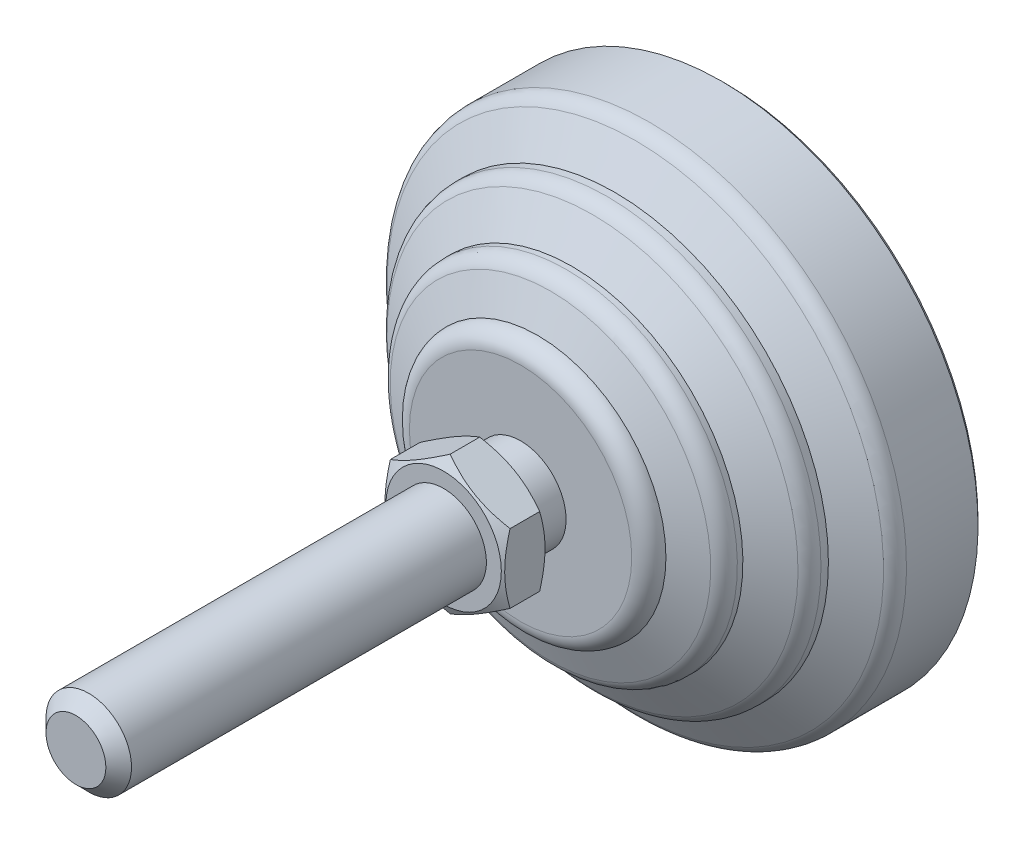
ISO-10303-21;
HEADER;
FILE_DESCRIPTION(('STEP AP214'),'2;1');
FILE_NAME('part.step','',(''),(''),'','','');
FILE_SCHEMA(('AUTOMOTIVE_DESIGN { 1 0 10303 214 1 1 1 1 }'));
ENDSEC;
DATA;
#1=APPLICATION_CONTEXT('core data for automotive mechanical design processes');
#2=APPLICATION_PROTOCOL_DEFINITION('international standard','automotive_design',2000,#1);
#3=PRODUCT_CONTEXT('',#1,'mechanical');
#4=PRODUCT('Part','Part','',(#3));
#5=PRODUCT_RELATED_PRODUCT_CATEGORY('part','',(#4));
#6=PRODUCT_DEFINITION_FORMATION('','',#4);
#7=PRODUCT_DEFINITION_CONTEXT('part definition',#1,'design');
#8=PRODUCT_DEFINITION('design','',#6,#7);
#9=PRODUCT_DEFINITION_SHAPE('','',#8);
#10=(LENGTH_UNIT() NAMED_UNIT(*) SI_UNIT(.MILLI.,.METRE.));
#11=(NAMED_UNIT(*) PLANE_ANGLE_UNIT() SI_UNIT($,.RADIAN.));
#12=(NAMED_UNIT(*) SI_UNIT($,.STERADIAN.) SOLID_ANGLE_UNIT());
#13=UNCERTAINTY_MEASURE_WITH_UNIT(LENGTH_MEASURE(1.E-05),#10,'distance_accuracy_value','');
#14=(GEOMETRIC_REPRESENTATION_CONTEXT(3) GLOBAL_UNCERTAINTY_ASSIGNED_CONTEXT((#13)) GLOBAL_UNIT_ASSIGNED_CONTEXT((#10,
#11,#12)) REPRESENTATION_CONTEXT('',''));
#15=CARTESIAN_POINT('',(0.,0.,0.));
#16=DIRECTION('',(0.,0.,1.));
#17=DIRECTION('',(1.,0.,0.));
#18=AXIS2_PLACEMENT_3D('',#15,#16,#17);
#19=CARTESIAN_POINT('',(-29.5,0.,0.));
#20=DIRECTION('',(0.,0.,1.));
#21=DIRECTION('',(0.,-1.,0.));
#22=AXIS2_PLACEMENT_3D('',#19,#20,#21);
#23=PLANE('',#22);
#24=CARTESIAN_POINT('',(0.,0.,0.));
#25=DIRECTION('',(0.,0.,-1.));
#26=DIRECTION('',(0.,1.,0.));
#27=AXIS2_PLACEMENT_3D('',#24,#25,#26);
#28=CIRCLE('',#27,29.5);
#29=CARTESIAN_POINT('',(0.,29.5,0.));
#30=VERTEX_POINT('',#29);
#31=EDGE_CURVE('E95',#30,#30,#28,.T.);
#32=ORIENTED_EDGE('',*,*,#31,.T.);
#33=EDGE_LOOP('',(#32));
#34=FACE_BOUND('',#33,.T.);
#35=ADVANCED_FACE('F14',(#34),#23,.F.);
#36=CARTESIAN_POINT('',(-5.32445501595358,0.,28.));
#37=DIRECTION('',(0.,0.,1.));
#38=DIRECTION('',(0.,-1.,0.));
#39=AXIS2_PLACEMENT_3D('',#36,#37,#38);
#40=PLANE('',#39);
#41=CARTESIAN_POINT('',(0.,0.,28.));
#42=DIRECTION('',(0.,0.,1.));
#43=DIRECTION('',(1.,0.,0.));
#44=AXIS2_PLACEMENT_3D('',#41,#42,#43);
#45=CIRCLE('',#44,6.75);
#46=CARTESIAN_POINT('',(6.75,0.,28.));
#47=VERTEX_POINT('',#46);
#48=EDGE_CURVE('E542',#47,#47,#45,.T.);
#49=ORIENTED_EDGE('',*,*,#48,.F.);
#50=EDGE_LOOP('',(#49));
#51=FACE_BOUND('',#50,.T.);
#52=CARTESIAN_POINT('',(0.,0.,28.));
#53=DIRECTION('',(0.,0.,-1.));
#54=DIRECTION('',(0.,1.,0.));
#55=AXIS2_PLACEMENT_3D('',#52,#53,#54);
#56=CIRCLE('',#55,5.32445501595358);
#57=CARTESIAN_POINT('',(0.,5.32445501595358,28.));
#58=VERTEX_POINT('',#57);
#59=EDGE_CURVE('E74',#58,#58,#56,.T.);
#60=ORIENTED_EDGE('',*,*,#59,.F.);
#61=EDGE_LOOP('',(#60));
#62=FACE_BOUND('',#61,.T.);
#63=ADVANCED_FACE('F271',(#51,#62),#40,.F.);
#64=CARTESIAN_POINT('',(0.,0.,0.));
#65=DIRECTION('',(0.,0.,-1.));
#66=DIRECTION('',(0.,1.,0.));
#67=AXIS2_PLACEMENT_3D('',#64,#65,#66);
#68=CYLINDRICAL_SURFACE('',#67,5.32445501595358);
#69=CARTESIAN_POINT('',(0.,0.,24.));
#70=DIRECTION('',(0.,0.,-1.));
#71=DIRECTION('',(0.,1.,0.));
#72=AXIS2_PLACEMENT_3D('',#69,#70,#71);
#73=CIRCLE('',#72,5.32445501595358);
#74=CARTESIAN_POINT('',(0.,5.32445501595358,24.));
#75=VERTEX_POINT('',#74);
#76=EDGE_CURVE('E131',#75,#75,#73,.T.);
#77=ORIENTED_EDGE('',*,*,#76,.F.);
#78=EDGE_LOOP('',(#77));
#79=FACE_BOUND('',#78,.T.);
#80=ORIENTED_EDGE('',*,*,#59,.T.);
#81=EDGE_LOOP('',(#80));
#82=FACE_BOUND('',#81,.T.);
#83=ADVANCED_FACE('F267',(#79,#82),#68,.T.);
#84=CARTESIAN_POINT('',(-13.,0.,24.));
#85=DIRECTION('',(0.,0.,-1.));
#86=DIRECTION('',(0.,1.,0.));
#87=AXIS2_PLACEMENT_3D('',#84,#85,#86);
#88=PLANE('',#87);
#89=CARTESIAN_POINT('',(0.,0.,24.));
#90=DIRECTION('',(0.,0.,-1.));
#91=DIRECTION('',(0.,1.,0.));
#92=AXIS2_PLACEMENT_3D('',#89,#90,#91);
#93=CIRCLE('',#92,13.);
#94=CARTESIAN_POINT('',(0.,13.,24.));
#95=VERTEX_POINT('',#94);
#96=EDGE_CURVE('E128',#95,#95,#93,.T.);
#97=ORIENTED_EDGE('',*,*,#96,.F.);
#98=EDGE_LOOP('',(#97));
#99=FACE_BOUND('',#98,.T.);
#100=ORIENTED_EDGE('',*,*,#76,.T.);
#101=EDGE_LOOP('',(#100));
#102=FACE_BOUND('',#101,.T.);
#103=ADVANCED_FACE('F263',(#99,#102),#88,.F.);
#104=CARTESIAN_POINT('',(0.,0.,22.));
#105=DIRECTION('',(0.,0.,-1.));
#106=DIRECTION('',(0.,1.,0.));
#107=AXIS2_PLACEMENT_3D('',#104,#105,#106);
#108=TOROIDAL_SURFACE('',#107,13.,2.);
#109=CARTESIAN_POINT('',(0.,0.,22.));
#110=DIRECTION('',(0.,0.,-1.));
#111=DIRECTION('',(0.,1.,0.));
#112=AXIS2_PLACEMENT_3D('',#109,#110,#111);
#113=CIRCLE('',#112,15.);
#114=CARTESIAN_POINT('',(0.,15.,22.));
#115=VERTEX_POINT('',#114);
#116=EDGE_CURVE('E125',#115,#115,#113,.T.);
#117=ORIENTED_EDGE('',*,*,#116,.F.);
#118=EDGE_LOOP('',(#117));
#119=FACE_BOUND('',#118,.T.);
#120=ORIENTED_EDGE('',*,*,#96,.T.);
#121=EDGE_LOOP('',(#120));
#122=FACE_BOUND('',#121,.T.);
#123=ADVANCED_FACE('F259',(#119,#122),#108,.T.);
#124=CARTESIAN_POINT('',(0.,0.,22.));
#125=DIRECTION('',(0.,0.,-1.));
#126=DIRECTION('',(0.,1.,0.));
#127=AXIS2_PLACEMENT_3D('',#124,#125,#126);
#128=CONICAL_SURFACE('',#127,15.,1.19028994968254);
#129=CARTESIAN_POINT('',(0.,0.,20.5028874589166));
#130=DIRECTION('',(0.,0.,-1.));
#131=DIRECTION('',(0.,1.,0.));
#132=AXIS2_PLACEMENT_3D('',#129,#130,#131);
#133=CIRCLE('',#132,18.7427813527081);
#134=CARTESIAN_POINT('',(0.,18.7427813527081,20.5028874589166));
#135=VERTEX_POINT('',#134);
#136=EDGE_CURVE('E122',#135,#135,#133,.T.);
#137=ORIENTED_EDGE('',*,*,#136,.F.);
#138=EDGE_LOOP('',(#137));
#139=FACE_BOUND('',#138,.T.);
#140=ORIENTED_EDGE('',*,*,#116,.T.);
#141=EDGE_LOOP('',(#140));
#142=FACE_BOUND('',#141,.T.);
#143=ADVANCED_FACE('F255',(#139,#142),#128,.T.);
#144=CARTESIAN_POINT('',(0.,0.,18.6459340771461));
#145=DIRECTION('',(0.,0.,-1.));
#146=DIRECTION('',(0.,1.,0.));
#147=AXIS2_PLACEMENT_3D('',#144,#145,#146);
#148=TOROIDAL_SURFACE('',#147,18.,2.00000000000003);
#149=CARTESIAN_POINT('',(0.,0.,18.645934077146));
#150=DIRECTION('',(0.,0.,-1.));
#151=DIRECTION('',(0.,1.,0.));
#152=AXIS2_PLACEMENT_3D('',#149,#150,#151);
#153=CIRCLE('',#152,20.);
#154=CARTESIAN_POINT('',(0.,20.,18.645934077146));
#155=VERTEX_POINT('',#154);
#156=EDGE_CURVE('E119',#155,#155,#153,.T.);
#157=ORIENTED_EDGE('',*,*,#156,.F.);
#158=EDGE_LOOP('',(#157));
#159=FACE_BOUND('',#158,.T.);
#160=ORIENTED_EDGE('',*,*,#136,.T.);
#161=EDGE_LOOP('',(#160));
#162=FACE_BOUND('',#161,.T.);
#163=ADVANCED_FACE('F251',(#159,#162),#148,.T.);
#164=CARTESIAN_POINT('',(0.,0.,0.));
#165=DIRECTION('',(0.,0.,-1.));
#166=DIRECTION('',(0.,1.,0.));
#167=AXIS2_PLACEMENT_3D('',#164,#165,#166);
#168=CYLINDRICAL_SURFACE('',#167,20.);
#169=CARTESIAN_POINT('',(0.,0.,18.));
#170=DIRECTION('',(0.,0.,-1.));
#171=DIRECTION('',(0.,1.,0.));
#172=AXIS2_PLACEMENT_3D('',#169,#170,#171);
#173=CIRCLE('',#172,20.);
#174=CARTESIAN_POINT('',(0.,20.,18.));
#175=VERTEX_POINT('',#174);
#176=EDGE_CURVE('E116',#175,#175,#173,.T.);
#177=ORIENTED_EDGE('',*,*,#176,.F.);
#178=EDGE_LOOP('',(#177));
#179=FACE_BOUND('',#178,.T.);
#180=ORIENTED_EDGE('',*,*,#156,.T.);
#181=EDGE_LOOP('',(#180));
#182=FACE_BOUND('',#181,.T.);
#183=ADVANCED_FACE('F247',(#179,#182),#168,.T.);
#184=CARTESIAN_POINT('',(0.,0.,18.));
#185=DIRECTION('',(0.,0.,-1.));
#186=DIRECTION('',(0.,1.,0.));
#187=AXIS2_PLACEMENT_3D('',#184,#185,#186);
#188=CONICAL_SURFACE('',#187,20.,1.03037682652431);
#189=CARTESIAN_POINT('',(0.,0.,15.5826050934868));
#190=DIRECTION('',(0.,0.,-1.));
#191=DIRECTION('',(0.,1.,0.));
#192=AXIS2_PLACEMENT_3D('',#189,#190,#191);
#193=CIRCLE('',#192,24.0289915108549);
#194=CARTESIAN_POINT('',(0.,24.0289915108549,15.5826050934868));
#195=VERTEX_POINT('',#194);
#196=EDGE_CURVE('E113',#195,#195,#193,.T.);
#197=ORIENTED_EDGE('',*,*,#196,.F.);
#198=EDGE_LOOP('',(#197));
#199=FACE_BOUND('',#198,.T.);
#200=ORIENTED_EDGE('',*,*,#176,.T.);
#201=EDGE_LOOP('',(#200));
#202=FACE_BOUND('',#201,.T.);
#203=ADVANCED_FACE('F243',(#199,#202),#188,.T.);
#204=CARTESIAN_POINT('',(0.,0.,13.8676192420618));
#205=DIRECTION('',(0.,0.,-1.));
#206=DIRECTION('',(0.,1.,0.));
#207=AXIS2_PLACEMENT_3D('',#204,#205,#206);
#208=TOROIDAL_SURFACE('',#207,23.,2.00000000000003);
#209=CARTESIAN_POINT('',(0.,0.,13.8676192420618));
#210=DIRECTION('',(0.,0.,-1.));
#211=DIRECTION('',(0.,1.,0.));
#212=AXIS2_PLACEMENT_3D('',#209,#210,#211);
#213=CIRCLE('',#212,25.);
#214=CARTESIAN_POINT('',(0.,25.,13.8676192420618));
#215=VERTEX_POINT('',#214);
#216=EDGE_CURVE('E110',#215,#215,#213,.T.);
#217=ORIENTED_EDGE('',*,*,#216,.F.);
#218=EDGE_LOOP('',(#217));
#219=FACE_BOUND('',#218,.T.);
#220=ORIENTED_EDGE('',*,*,#196,.T.);
#221=EDGE_LOOP('',(#220));
#222=FACE_BOUND('',#221,.T.);
#223=ADVANCED_FACE('F239',(#219,#222),#208,.T.);
#224=CARTESIAN_POINT('',(0.,0.,0.));
#225=DIRECTION('',(0.,0.,-1.));
#226=DIRECTION('',(0.,1.,0.));
#227=AXIS2_PLACEMENT_3D('',#224,#225,#226);
#228=CYLINDRICAL_SURFACE('',#227,25.);
#229=CARTESIAN_POINT('',(0.,0.,13.));
#230=DIRECTION('',(0.,0.,-1.));
#231=DIRECTION('',(0.,1.,0.));
#232=AXIS2_PLACEMENT_3D('',#229,#230,#231);
#233=CIRCLE('',#232,25.);
#234=CARTESIAN_POINT('',(0.,25.,13.));
#235=VERTEX_POINT('',#234);
#236=EDGE_CURVE('E107',#235,#235,#233,.T.);
#237=ORIENTED_EDGE('',*,*,#236,.F.);
#238=EDGE_LOOP('',(#237));
#239=FACE_BOUND('',#238,.T.);
#240=ORIENTED_EDGE('',*,*,#216,.T.);
#241=EDGE_LOOP('',(#240));
#242=FACE_BOUND('',#241,.T.);
#243=ADVANCED_FACE('F235',(#239,#242),#228,.T.);
#244=CARTESIAN_POINT('',(0.,0.,13.));
#245=DIRECTION('',(0.,0.,-1.));
#246=DIRECTION('',(0.,1.,0.));
#247=AXIS2_PLACEMENT_3D('',#244,#245,#246);
#248=CONICAL_SURFACE('',#247,25.,1.03037682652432);
#249=CARTESIAN_POINT('',(0.,0.,10.5826050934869));
#250=DIRECTION('',(0.,0.,-1.));
#251=DIRECTION('',(0.,1.,0.));
#252=AXIS2_PLACEMENT_3D('',#249,#250,#251);
#253=CIRCLE('',#252,29.028991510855);
#254=CARTESIAN_POINT('',(0.,29.028991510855,10.5826050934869));
#255=VERTEX_POINT('',#254);
#256=EDGE_CURVE('E104',#255,#255,#253,.T.);
#257=ORIENTED_EDGE('',*,*,#256,.F.);
#258=EDGE_LOOP('',(#257));
#259=FACE_BOUND('',#258,.T.);
#260=ORIENTED_EDGE('',*,*,#236,.T.);
#261=EDGE_LOOP('',(#260));
#262=FACE_BOUND('',#261,.T.);
#263=ADVANCED_FACE('F231',(#259,#262),#248,.T.);
#264=CARTESIAN_POINT('',(0.,0.,8.86761924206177));
#265=DIRECTION('',(0.,0.,-1.));
#266=DIRECTION('',(0.,1.,0.));
#267=AXIS2_PLACEMENT_3D('',#264,#265,#266);
#268=TOROIDAL_SURFACE('',#267,28.,2.00000000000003);
#269=CARTESIAN_POINT('',(0.,0.,8.86761924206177));
#270=DIRECTION('',(0.,0.,-1.));
#271=DIRECTION('',(0.,1.,0.));
#272=AXIS2_PLACEMENT_3D('',#269,#270,#271);
#273=CIRCLE('',#272,30.);
#274=CARTESIAN_POINT('',(0.,30.,8.86761924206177));
#275=VERTEX_POINT('',#274);
#276=EDGE_CURVE('E101',#275,#275,#273,.T.);
#277=ORIENTED_EDGE('',*,*,#276,.F.);
#278=EDGE_LOOP('',(#277));
#279=FACE_BOUND('',#278,.T.);
#280=ORIENTED_EDGE('',*,*,#256,.T.);
#281=EDGE_LOOP('',(#280));
#282=FACE_BOUND('',#281,.T.);
#283=ADVANCED_FACE('F227',(#279,#282),#268,.T.);
#284=CARTESIAN_POINT('',(0.,0.,0.));
#285=DIRECTION('',(0.,0.,-1.));
#286=DIRECTION('',(0.,1.,0.));
#287=AXIS2_PLACEMENT_3D('',#284,#285,#286);
#288=CYLINDRICAL_SURFACE('',#287,30.);
#289=CARTESIAN_POINT('',(0.,0.,0.499999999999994));
#290=DIRECTION('',(0.,0.,-1.));
#291=DIRECTION('',(0.,1.,0.));
#292=AXIS2_PLACEMENT_3D('',#289,#290,#291);
#293=CIRCLE('',#292,30.);
#294=CARTESIAN_POINT('',(0.,30.,0.499999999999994));
#295=VERTEX_POINT('',#294);
#296=EDGE_CURVE('E98',#295,#295,#293,.T.);
#297=ORIENTED_EDGE('',*,*,#296,.F.);
#298=EDGE_LOOP('',(#297));
#299=FACE_BOUND('',#298,.T.);
#300=ORIENTED_EDGE('',*,*,#276,.T.);
#301=EDGE_LOOP('',(#300));
#302=FACE_BOUND('',#301,.T.);
#303=ADVANCED_FACE('F223',(#299,#302),#288,.T.);
#304=CARTESIAN_POINT('',(0.,0.,0.499999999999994));
#305=DIRECTION('',(0.,0.,1.));
#306=DIRECTION('',(0.,-1.,0.));
#307=AXIS2_PLACEMENT_3D('',#304,#305,#306);
#308=CONICAL_SURFACE('',#307,30.,0.785398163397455);
#309=ORIENTED_EDGE('',*,*,#31,.F.);
#310=EDGE_LOOP('',(#309));
#311=FACE_BOUND('',#310,.T.);
#312=ORIENTED_EDGE('',*,*,#296,.T.);
#313=EDGE_LOOP('',(#312));
#314=FACE_BOUND('',#313,.T.);
#315=ADVANCED_FACE('F150',(#311,#314),#308,.T.);
#316=CARTESIAN_POINT('',(0.,0.,28.));
#317=DIRECTION('',(0.,0.,1.));
#318=DIRECTION('',(1.,0.,0.));
#319=AXIS2_PLACEMENT_3D('',#316,#317,#318);
#320=CONICAL_SURFACE('',#319,6.75,1.0471975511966);
#321=CARTESIAN_POINT('',(0.000200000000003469,-8.0830192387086,28.7696190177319));
#322=CARTESIAN_POINT('',(-0.153667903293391,-7.99418356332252,28.7183374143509));
#323=CARTESIAN_POINT('',(-0.30810950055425,-7.90501666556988,28.669383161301));
#324=CARTESIAN_POINT('',(-0.618246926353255,-7.72595873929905,28.5767703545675));
#325=CARTESIAN_POINT('',(-0.773943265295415,-7.63606741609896,28.5331140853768));
#326=CARTESIAN_POINT('',(-1.24352516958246,-7.36495417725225,28.4109491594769));
#327=CARTESIAN_POINT('',(-1.5592643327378,-7.18266208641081,28.3414631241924));
#328=CARTESIAN_POINT('',(-2.03176224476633,-6.90986528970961,28.2599825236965));
#329=CARTESIAN_POINT('',(-2.18710922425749,-6.82017566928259,28.2367710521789));
#330=CARTESIAN_POINT('',(-2.49850511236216,-6.64039116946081,28.1978487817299));
#331=CARTESIAN_POINT('',(-2.65455395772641,-6.55029632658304,28.1821373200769));
#332=CARTESIAN_POINT('',(-2.96692267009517,-6.36995016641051,28.1586154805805));
#333=CARTESIAN_POINT('',(-3.12324202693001,-6.27969914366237,28.1507961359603));
#334=CARTESIAN_POINT('',(-3.43601650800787,-6.09911871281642,28.1432178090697));
#335=CARTESIAN_POINT('',(-3.59247162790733,-6.00878930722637,28.1434585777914));
#336=CARTESIAN_POINT('',(-4.02110687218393,-5.76131663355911,28.155197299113));
#337=CARTESIAN_POINT('',(-4.2931466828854,-5.60425437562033,28.1749033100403));
#338=CARTESIAN_POINT('',(-4.83541944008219,-5.29117305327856,28.2373910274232));
#339=CARTESIAN_POINT('',(-5.10565047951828,-5.13515508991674,28.2801940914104));
#340=CARTESIAN_POINT('',(-5.64901454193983,-4.82144370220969,28.3871892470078));
#341=CARTESIAN_POINT('',(-5.92207900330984,-4.6637898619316,28.4518346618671));
#342=CARTESIAN_POINT('',(-6.46413578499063,-4.35083323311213,28.5985536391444));
#343=CARTESIAN_POINT('',(-6.73313504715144,-4.19552643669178,28.680592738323));
#344=CARTESIAN_POINT('',(-7.0002,-4.04133641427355,28.7696190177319));
#345=B_SPLINE_CURVE_WITH_KNOTS('',3,(#321,#322,#323,#324,#325,#326,#327,#328,#329,#330,#331,
#332,#333,#334,#335,#336,#337,#338,#339,#340,#341,#342,#343,#344),.UNSPECIFIED.,.F.,.F.,(4,2,2,
2,2,2,2,2,2,2,2,4),(0.,0.554727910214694,1.10969417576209,2.2219327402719,2.76443041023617,
3.30688013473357,3.8487128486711,4.39052882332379,5.33376515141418,6.27787517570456,
7.24292418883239,8.20607866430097),.UNSPECIFIED.);
#346=CARTESIAN_POINT('',(0.,-8.08290376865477,28.7695523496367));
#347=VERTEX_POINT('',#346);
#348=CARTESIAN_POINT('',(-7.,-4.04145188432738,28.7695523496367));
#349=VERTEX_POINT('',#348);
#350=EDGE_CURVE('E69',#347,#349,#345,.T.);
#351=ORIENTED_EDGE('',*,*,#350,.T.);
#352=CARTESIAN_POINT('',(-7.,-10.844546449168,31.5550484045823));
#353=CARTESIAN_POINT('',(-7.,-10.5389041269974,31.4068299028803));
#354=CARTESIAN_POINT('',(-7.,-10.2325589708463,31.2600358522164));
#355=CARTESIAN_POINT('',(-7.,-9.61808916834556,30.9700980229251));
#356=CARTESIAN_POINT('',(-7.,-9.30996424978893,30.8269548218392));
#357=CARTESIAN_POINT('',(-7.,-8.68996814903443,30.5443975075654));
#358=CARTESIAN_POINT('',(-7.,-8.37808569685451,30.4050080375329));
#359=CARTESIAN_POINT('',(-7.,-7.75183627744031,30.1319484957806));
#360=CARTESIAN_POINT('',(-7.,-7.43746942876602,29.9982781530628));
#361=CARTESIAN_POINT('',(-7.,-6.79564890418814,29.7340076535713));
#362=CARTESIAN_POINT('',(-7.,-6.46809807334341,29.6036421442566));
#363=CARTESIAN_POINT('',(-7.,-5.80916092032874,29.3528049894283));
#364=CARTESIAN_POINT('',(-7.,-5.47777417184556,29.232334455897));
#365=CARTESIAN_POINT('',(-7.,-4.81125785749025,29.0044584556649));
#366=CARTESIAN_POINT('',(-7.,-4.47613746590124,28.8970264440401));
#367=CARTESIAN_POINT('',(-7.,-3.80110167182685,28.6986808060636));
#368=CARTESIAN_POINT('',(-7.,-3.46118781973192,28.6077619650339));
#369=CARTESIAN_POINT('',(-7.,-2.77819933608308,28.4473021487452));
#370=CARTESIAN_POINT('',(-7.,-2.43515258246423,28.3776457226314));
#371=CARTESIAN_POINT('',(-7.,-1.91746759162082,28.2921293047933));
#372=CARTESIAN_POINT('',(-7.,-1.74437399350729,28.2667840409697));
#373=CARTESIAN_POINT('',(-7.,-1.39733027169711,28.222913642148));
#374=CARTESIAN_POINT('',(-7.,-1.22338023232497,28.2043878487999));
#375=CARTESIAN_POINT('',(-7.,-0.877124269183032,28.1747572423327));
#376=CARTESIAN_POINT('',(-7.,-0.704826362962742,28.1635591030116));
#377=CARTESIAN_POINT('',(-7.,-0.359911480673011,28.1484581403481));
#378=CARTESIAN_POINT('',(-7.,-0.187294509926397,28.144555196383));
#379=CARTESIAN_POINT('',(-7.,0.157950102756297,28.1441376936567));
#380=CARTESIAN_POINT('',(-7.,0.330577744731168,28.1476231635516));
#381=CARTESIAN_POINT('',(-7.,0.675533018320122,28.1618975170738));
#382=CARTESIAN_POINT('',(-7.,0.847860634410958,28.1726867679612));
#383=CARTESIAN_POINT('',(-7.,1.26235657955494,28.2071940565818));
#384=CARTESIAN_POINT('',(-7.,1.50424091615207,28.2343963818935));
#385=CARTESIAN_POINT('',(-7.,1.98619555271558,28.3017040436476));
#386=CARTESIAN_POINT('',(-7.,2.22626560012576,28.3418111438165));
#387=CARTESIAN_POINT('',(-7.,2.94349027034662,28.4793613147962));
#388=CARTESIAN_POINT('',(-7.,3.4173882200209,28.5940077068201));
#389=CARTESIAN_POINT('',(-7.,4.12597985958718,28.7925823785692));
#390=CARTESIAN_POINT('',(-7.,4.36435477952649,28.8641280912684));
#391=CARTESIAN_POINT('',(-7.,4.83878893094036,29.0145927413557));
#392=CARTESIAN_POINT('',(-7.,5.07484814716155,29.093511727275));
#393=CARTESIAN_POINT('',(-7.,5.54472628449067,29.2574614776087));
#394=CARTESIAN_POINT('',(-7.,5.77854592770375,29.342490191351));
#395=CARTESIAN_POINT('',(-7.,6.24425179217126,29.5176647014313));
#396=CARTESIAN_POINT('',(-7.,6.47613803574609,29.6078104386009));
#397=CARTESIAN_POINT('',(-7.,7.02208902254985,29.8258788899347));
#398=CARTESIAN_POINT('',(-7.,7.33542067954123,29.9556335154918));
#399=CARTESIAN_POINT('',(-7.,7.95943200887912,30.2213883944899));
#400=CARTESIAN_POINT('',(-7.,8.27011152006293,30.3573890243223));
#401=CARTESIAN_POINT('',(-7.,8.88930487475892,30.6343847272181));
#402=CARTESIAN_POINT('',(-7.,9.19781827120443,30.7753807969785));
#403=CARTESIAN_POINT('',(-7.,9.81299002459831,31.0613703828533));
#404=CARTESIAN_POINT('',(-7.,10.1196483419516,31.2063639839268));
#405=CARTESIAN_POINT('',(-7.,10.7317317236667,31.4997527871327));
#406=CARTESIAN_POINT('',(-7.,11.0371551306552,31.6481514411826));
#407=CARTESIAN_POINT('',(-7.,11.6466883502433,31.947624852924));
#408=CARTESIAN_POINT('',(-7.,11.9507981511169,32.0986996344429));
#409=CARTESIAN_POINT('',(-7.,12.861390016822,32.5551879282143));
#410=CARTESIAN_POINT('',(-7.,13.4662159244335,32.8639047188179));
#411=CARTESIAN_POINT('',(-7.,14.6222304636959,33.4614715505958));
#412=CARTESIAN_POINT('',(-7.,15.1736767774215,33.7498253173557));
#413=CARTESIAN_POINT('',(-7.,16.2745203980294,34.3304616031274));
#414=CARTESIAN_POINT('',(-7.,16.823917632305,34.6227442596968));
#415=CARTESIAN_POINT('',(-7.,17.9197531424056,35.2095745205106));
#416=CARTESIAN_POINT('',(-7.,18.4661953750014,35.5041147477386));
#417=CARTESIAN_POINT('',(-7.,19.5577691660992,36.0955438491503));
#418=CARTESIAN_POINT('',(-7.,20.1029007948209,36.3924325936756));
#419=CARTESIAN_POINT('',(-7.,20.647549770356,36.690198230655));
#420=B_SPLINE_CURVE_WITH_KNOTS('',3,(#352,#353,#354,#355,#356,#357,#358,#359,#360,#361,#362,
#363,#364,#365,#366,#367,#368,#369,#370,#371,#372,#373,#374,#375,#376,#377,#378,#379,#380,#381,
#382,#383,#384,#385,#386,#387,#388,#389,#390,#391,#392,#393,#394,#395,#396,#397,#398,#399,#400,
#401,#402,#403,#404,#405,#406,#407,#408,#409,#410,#411,#412,#413,#414,#415,#416,#417,#418,#419),
.UNSPECIFIED.,.F.,.F.,(4,2,2,2,2,2,2,2,2,2,2,2,2,2,2,2,2,2,2,2,2,2,2,2,2,2,2,2,2,2,2,2,2,4),(0.,
1.01906773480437,2.03829569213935,3.06309152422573,4.0878387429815,5.14533581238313,
6.20295155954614,7.25837665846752,8.31346788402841,9.36272385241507,9.88742869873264,
10.4120828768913,10.9299177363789,11.4477440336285,11.9655723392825,12.4834266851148,
13.2132414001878,13.9431559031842,15.4037984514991,16.1503776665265,16.8969617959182,
17.643296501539,18.3896225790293,19.406938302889,20.4243154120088,21.4418966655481,
22.4594995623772,23.478184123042,24.4968777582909,26.5339939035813,28.4008375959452,
30.2677468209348,32.1300450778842,33.9922412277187),.UNSPECIFIED.);
#421=CARTESIAN_POINT('',(-7.,4.04145188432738,28.7695523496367));
#422=VERTEX_POINT('',#421);
#423=EDGE_CURVE('E80',#349,#422,#420,.T.);
#424=ORIENTED_EDGE('',*,*,#423,.T.);
#425=CARTESIAN_POINT('',(-7.0002,4.04133641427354,28.7696190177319));
#426=CARTESIAN_POINT('',(-6.84633209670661,4.13017208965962,28.7183374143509));
#427=CARTESIAN_POINT('',(-6.69189049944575,4.21933898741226,28.669383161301));
#428=CARTESIAN_POINT('',(-6.38175307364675,4.39839691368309,28.5767703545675));
#429=CARTESIAN_POINT('',(-6.22605673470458,4.48828823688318,28.5331140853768));
#430=CARTESIAN_POINT('',(-5.75647483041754,4.75940147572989,28.4109491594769));
#431=CARTESIAN_POINT('',(-5.4407356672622,4.94169356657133,28.3414631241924));
#432=CARTESIAN_POINT('',(-4.96823775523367,5.21449036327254,28.2599825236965));
#433=CARTESIAN_POINT('',(-4.81289077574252,5.30417998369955,28.2367710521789));
#434=CARTESIAN_POINT('',(-4.50149488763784,5.48396448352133,28.1978487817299));
#435=CARTESIAN_POINT('',(-4.34544604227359,5.57405932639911,28.1821373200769));
#436=CARTESIAN_POINT('',(-4.03307732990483,5.75440548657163,28.1586154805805));
#437=CARTESIAN_POINT('',(-3.87675797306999,5.84465650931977,28.1507961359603));
#438=CARTESIAN_POINT('',(-3.56398349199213,6.02523694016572,28.1432178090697));
#439=CARTESIAN_POINT('',(-3.40752837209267,6.11556634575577,28.1434585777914));
#440=CARTESIAN_POINT('',(-2.97889312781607,6.36303901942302,28.155197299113));
#441=CARTESIAN_POINT('',(-2.7068533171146,6.52010127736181,28.1749033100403));
#442=CARTESIAN_POINT('',(-2.16458055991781,6.83318259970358,28.2373910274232));
#443=CARTESIAN_POINT('',(-1.89434952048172,6.9892005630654,28.2801940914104));
#444=CARTESIAN_POINT('',(-1.35098545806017,7.30291195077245,28.3871892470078));
#445=CARTESIAN_POINT('',(-1.07792099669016,7.46056579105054,28.4518346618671));
#446=CARTESIAN_POINT('',(-0.535864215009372,7.77352241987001,28.5985536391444));
#447=CARTESIAN_POINT('',(-0.266864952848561,7.92882921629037,28.680592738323));
#448=CARTESIAN_POINT('',(0.000199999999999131,8.0830192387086,28.7696190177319));
#449=B_SPLINE_CURVE_WITH_KNOTS('',3,(#425,#426,#427,#428,#429,#430,#431,#432,#433,#434,#435,
#436,#437,#438,#439,#440,#441,#442,#443,#444,#445,#446,#447,#448),.UNSPECIFIED.,.F.,.F.,(4,2,2,
2,2,2,2,2,2,2,2,4),(0.,0.554727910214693,1.10969417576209,2.2219327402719,2.76443041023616,
3.30688013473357,3.84871284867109,4.39052882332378,5.33376515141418,6.27787517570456,
7.2429241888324,8.20607866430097),.UNSPECIFIED.);
#450=CARTESIAN_POINT('',(0.,8.08290376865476,28.7695523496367));
#451=VERTEX_POINT('',#450);
#452=EDGE_CURVE('E175',#422,#451,#449,.T.);
#453=ORIENTED_EDGE('',*,*,#452,.T.);
#454=CARTESIAN_POINT('',(-0.000200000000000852,8.0830192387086,28.7696190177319));
#455=CARTESIAN_POINT('',(0.15366790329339,7.99418356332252,28.7183374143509));
#456=CARTESIAN_POINT('',(0.308109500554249,7.90501666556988,28.669383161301));
#457=CARTESIAN_POINT('',(0.618246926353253,7.72595873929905,28.5767703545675));
#458=CARTESIAN_POINT('',(0.773943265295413,7.63606741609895,28.5331140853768));
#459=CARTESIAN_POINT('',(1.24352516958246,7.36495417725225,28.4109491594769));
#460=CARTESIAN_POINT('',(1.5592643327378,7.18266208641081,28.3414631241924));
#461=CARTESIAN_POINT('',(2.03176224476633,6.9098652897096,28.2599825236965));
#462=CARTESIAN_POINT('',(2.18710922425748,6.82017566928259,28.2367710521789));
#463=CARTESIAN_POINT('',(2.49850511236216,6.64039116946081,28.1978487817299));
#464=CARTESIAN_POINT('',(2.65455395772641,6.55029632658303,28.1821373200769));
#465=CARTESIAN_POINT('',(2.96692267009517,6.36995016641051,28.1586154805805));
#466=CARTESIAN_POINT('',(3.12324202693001,6.27969914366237,28.1507961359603));
#467=CARTESIAN_POINT('',(3.43601650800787,6.09911871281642,28.1432178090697));
#468=CARTESIAN_POINT('',(3.59247162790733,6.00878930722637,28.1434585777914));
#469=CARTESIAN_POINT('',(4.02110687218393,5.76131663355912,28.155197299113));
#470=CARTESIAN_POINT('',(4.2931466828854,5.60425437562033,28.1749033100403));
#471=CARTESIAN_POINT('',(4.83541944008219,5.29117305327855,28.2373910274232));
#472=CARTESIAN_POINT('',(5.10565047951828,5.13515508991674,28.2801940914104));
#473=CARTESIAN_POINT('',(5.64901454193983,4.82144370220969,28.3871892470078));
#474=CARTESIAN_POINT('',(5.92207900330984,4.66378986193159,28.4518346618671));
#475=CARTESIAN_POINT('',(6.46413578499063,4.35083323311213,28.5985536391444));
#476=CARTESIAN_POINT('',(6.73313504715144,4.19552643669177,28.680592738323));
#477=CARTESIAN_POINT('',(7.0002,4.04133641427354,28.7696190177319));
#478=B_SPLINE_CURVE_WITH_KNOTS('',3,(#454,#455,#456,#457,#458,#459,#460,#461,#462,#463,#464,
#465,#466,#467,#468,#469,#470,#471,#472,#473,#474,#475,#476,#477),.UNSPECIFIED.,.F.,.F.,(4,2,2,
2,2,2,2,2,2,2,2,4),(0.,0.554727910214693,1.10969417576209,2.2219327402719,2.76443041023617,
3.30688013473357,3.8487128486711,4.39052882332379,5.33376515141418,6.27787517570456,
7.2429241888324,8.20607866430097),.UNSPECIFIED.);
#479=CARTESIAN_POINT('',(7.,4.04145188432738,28.7695523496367));
#480=VERTEX_POINT('',#479);
#481=EDGE_CURVE('E168',#451,#480,#478,.T.);
#482=ORIENTED_EDGE('',*,*,#481,.T.);
#483=CARTESIAN_POINT('',(7.,-10.8445464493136,31.5550484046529));
#484=CARTESIAN_POINT('',(7.,-10.5389041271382,31.406829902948));
#485=CARTESIAN_POINT('',(7.,-10.2325589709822,31.2600358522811));
#486=CARTESIAN_POINT('',(7.,-9.61808916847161,30.970098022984));
#487=CARTESIAN_POINT('',(7.,-9.30996424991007,30.8269548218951));
#488=CARTESIAN_POINT('',(7.,-8.68996814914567,30.5443975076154));
#489=CARTESIAN_POINT('',(7.,-8.37808569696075,30.4050080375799));
#490=CARTESIAN_POINT('',(7.,-7.75183627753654,30.1319484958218));
#491=CARTESIAN_POINT('',(7.,-7.43746942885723,29.9982781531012));
#492=CARTESIAN_POINT('',(7.,-6.79564890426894,29.7340076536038));
#493=CARTESIAN_POINT('',(7.,-6.46809807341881,29.6036421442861));
#494=CARTESIAN_POINT('',(7.,-5.80916092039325,29.3528049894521));
#495=CARTESIAN_POINT('',(7.,-5.47777417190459,29.2323344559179));
#496=CARTESIAN_POINT('',(7.,-4.81125785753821,29.0044584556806));
#497=CARTESIAN_POINT('',(7.,-4.47613746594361,28.8970264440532));
#498=CARTESIAN_POINT('',(7.,-3.80110167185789,28.6986808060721));
#499=CARTESIAN_POINT('',(7.,-3.46118781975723,28.6077619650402));
#500=CARTESIAN_POINT('',(7.,-2.77819933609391,28.4473021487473));
#501=CARTESIAN_POINT('',(7.,-2.43515258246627,28.3776457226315));
#502=CARTESIAN_POINT('',(7.,-1.91746759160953,28.2921293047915));
#503=CARTESIAN_POINT('',(7.,-1.74437399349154,28.2667840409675));
#504=CARTESIAN_POINT('',(7.,-1.3973302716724,28.2229136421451));
#505=CARTESIAN_POINT('',(7.,-1.22338023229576,28.204387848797));
#506=CARTESIAN_POINT('',(7.,-0.877124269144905,28.1747572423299));
#507=CARTESIAN_POINT('',(7.,-0.704826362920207,28.1635591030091));
#508=CARTESIAN_POINT('',(7.,-0.359911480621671,28.1484581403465));
#509=CARTESIAN_POINT('',(7.,-0.187294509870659,28.1445551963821));
#510=CARTESIAN_POINT('',(7.,0.157950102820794,28.1441376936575));
#511=CARTESIAN_POINT('',(7.,0.330577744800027,28.1476231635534));
#512=CARTESIAN_POINT('',(7.,0.675533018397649,28.1618975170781));
#513=CARTESIAN_POINT('',(7.,0.847860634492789,28.1726867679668));
#514=CARTESIAN_POINT('',(7.,1.26235657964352,28.2071940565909));
#515=CARTESIAN_POINT('',(7.,1.50424091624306,28.2343963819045));
#516=CARTESIAN_POINT('',(7.,1.98619555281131,28.3017040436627));
#517=CARTESIAN_POINT('',(7.,2.22626560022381,28.3418111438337));
#518=CARTESIAN_POINT('',(7.,2.94349027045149,28.4793613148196));
#519=CARTESIAN_POINT('',(7.,3.41738822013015,28.5940077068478));
#520=CARTESIAN_POINT('',(7.,4.12597985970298,28.7925823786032));
#521=CARTESIAN_POINT('',(7.,4.3643547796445,28.8641280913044));
#522=CARTESIAN_POINT('',(7.,4.8387889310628,29.0145927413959));
#523=CARTESIAN_POINT('',(7.,5.0748481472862,29.0935117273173));
#524=CARTESIAN_POINT('',(7.,5.54472628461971,29.2574614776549));
#525=CARTESIAN_POINT('',(7.,5.77854592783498,29.3424901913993));
#526=CARTESIAN_POINT('',(7.,6.24425179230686,29.5176647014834));
#527=CARTESIAN_POINT('',(7.,6.47613803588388,29.6078104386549));
#528=CARTESIAN_POINT('',(7.,7.02208902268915,29.8258788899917));
#529=CARTESIAN_POINT('',(7.,7.3354206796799,29.9556335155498));
#530=CARTESIAN_POINT('',(7.,7.9594320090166,30.2213883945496));
#531=CARTESIAN_POINT('',(7.,8.27011152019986,30.3573890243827));
#532=CARTESIAN_POINT('',(7.,8.88930487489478,30.6343847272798));
#533=CARTESIAN_POINT('',(7.,9.1978182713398,30.7753807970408));
#534=CARTESIAN_POINT('',(7.,9.81299002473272,31.0613703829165));
#535=CARTESIAN_POINT('',(7.,10.1196483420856,31.2063639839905));
#536=CARTESIAN_POINT('',(7.,10.7317317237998,31.4997527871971));
#537=CARTESIAN_POINT('',(7.,11.0371551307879,31.6481514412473));
#538=CARTESIAN_POINT('',(7.,11.6466883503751,31.9476248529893));
#539=CARTESIAN_POINT('',(7.,11.9507981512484,32.0986996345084));
#540=CARTESIAN_POINT('',(7.,12.8613900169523,32.5551879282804));
#541=CARTESIAN_POINT('',(7.,13.4662159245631,32.8639047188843));
#542=CARTESIAN_POINT('',(7.,14.6222304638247,33.4614715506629));
#543=CARTESIAN_POINT('',(7.,15.1736767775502,33.7498253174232));
#544=CARTESIAN_POINT('',(7.,16.2745203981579,34.3304616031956));
#545=CARTESIAN_POINT('',(7.,16.8239176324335,34.6227442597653));
#546=CARTESIAN_POINT('',(7.,17.9197531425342,35.2095745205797));
#547=CARTESIAN_POINT('',(7.,18.4661953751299,35.504114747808));
#548=CARTESIAN_POINT('',(7.,19.5577691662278,36.0955438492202));
#549=CARTESIAN_POINT('',(7.,20.1029007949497,36.3924325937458));
#550=CARTESIAN_POINT('',(7.,20.6475497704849,36.6901982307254));
#551=B_SPLINE_CURVE_WITH_KNOTS('',3,(#483,#484,#485,#486,#487,#488,#489,#490,#491,#492,#493,
#494,#495,#496,#497,#498,#499,#500,#501,#502,#503,#504,#505,#506,#507,#508,#509,#510,#511,#512,
#513,#514,#515,#516,#517,#518,#519,#520,#521,#522,#523,#524,#525,#526,#527,#528,#529,#530,#531,
#532,#533,#534,#535,#536,#537,#538,#539,#540,#541,#542,#543,#544,#545,#546,#547,#548,#549,#550),
.UNSPECIFIED.,.F.,.F.,(4,2,2,2,2,2,2,2,2,2,2,2,2,2,2,2,2,2,2,2,2,2,2,2,2,2,2,2,2,2,2,2,2,4),(0.,
1.01906773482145,2.03829569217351,3.06309152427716,4.08783874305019,5.14533581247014,
6.20295155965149,7.25837665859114,8.31346788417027,9.36272385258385,9.88742869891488,
10.412082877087,10.9299177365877,11.4477440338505,11.9655723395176,12.483426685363,
13.2132414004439,13.9431559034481,15.4037984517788,16.1503776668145,16.8969617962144,
17.6432965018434,18.3896225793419,19.4069383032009,20.4243154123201,21.4418966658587,
22.4594995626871,23.4781841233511,24.4968777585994,26.5339939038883,28.4008375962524,
30.2677468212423,32.1300450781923,33.9922412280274),.UNSPECIFIED.);
#552=CARTESIAN_POINT('',(7.,-4.04145188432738,28.7695523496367));
#553=VERTEX_POINT('',#552);
#554=EDGE_CURVE('E29',#480,#553,#551,.F.);
#555=ORIENTED_EDGE('',*,*,#554,.T.);
#556=CARTESIAN_POINT('',(7.0002,-4.04133641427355,28.7696190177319));
#557=CARTESIAN_POINT('',(6.84633209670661,-4.13017208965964,28.7183374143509));
#558=CARTESIAN_POINT('',(6.69189049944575,-4.21933898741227,28.669383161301));
#559=CARTESIAN_POINT('',(6.38175307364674,-4.3983969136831,28.5767703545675));
#560=CARTESIAN_POINT('',(6.22605673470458,-4.4882882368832,28.5331140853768));
#561=CARTESIAN_POINT('',(5.75647483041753,-4.7594014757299,28.4109491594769));
#562=CARTESIAN_POINT('',(5.4407356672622,-4.94169356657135,28.3414631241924));
#563=CARTESIAN_POINT('',(4.96823775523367,-5.21449036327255,28.2599825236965));
#564=CARTESIAN_POINT('',(4.81289077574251,-5.30417998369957,28.2367710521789));
#565=CARTESIAN_POINT('',(4.50149488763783,-5.48396448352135,28.1978487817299));
#566=CARTESIAN_POINT('',(4.34544604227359,-5.57405932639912,28.1821373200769));
#567=CARTESIAN_POINT('',(4.03307732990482,-5.75440548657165,28.1586154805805));
#568=CARTESIAN_POINT('',(3.87675797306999,-5.84465650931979,28.1507961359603));
#569=CARTESIAN_POINT('',(3.56398349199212,-6.02523694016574,28.1432178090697));
#570=CARTESIAN_POINT('',(3.40752837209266,-6.11556634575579,28.1434585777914));
#571=CARTESIAN_POINT('',(2.97889312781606,-6.36303901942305,28.155197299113));
#572=CARTESIAN_POINT('',(2.7068533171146,-6.52010127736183,28.1749033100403));
#573=CARTESIAN_POINT('',(2.1645805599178,-6.8331825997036,28.2373910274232));
#574=CARTESIAN_POINT('',(1.89434952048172,-6.98920056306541,28.2801940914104));
#575=CARTESIAN_POINT('',(1.35098545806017,-7.30291195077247,28.3871892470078));
#576=CARTESIAN_POINT('',(1.07792099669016,-7.46056579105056,28.4518346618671));
#577=CARTESIAN_POINT('',(0.535864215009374,-7.77352241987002,28.5985536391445));
#578=CARTESIAN_POINT('',(0.266864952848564,-7.92882921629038,28.680592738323));
#579=CARTESIAN_POINT('',(-0.000199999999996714,-8.08301923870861,28.7696190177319));
#580=B_SPLINE_CURVE_WITH_KNOTS('',3,(#556,#557,#558,#559,#560,#561,#562,#563,#564,#565,#566,
#567,#568,#569,#570,#571,#572,#573,#574,#575,#576,#577,#578,#579),.UNSPECIFIED.,.F.,.F.,(4,2,2,
2,2,2,2,2,2,2,2,4),(0.,0.554727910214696,1.10969417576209,2.2219327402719,2.76443041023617,
3.30688013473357,3.8487128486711,4.39052882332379,5.33376515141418,6.27787517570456,
7.24292418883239,8.20607866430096),.UNSPECIFIED.);
#581=EDGE_CURVE('E66',#553,#347,#580,.T.);
#582=ORIENTED_EDGE('',*,*,#581,.T.);
#583=EDGE_LOOP('',(#351,#424,#453,#482,#555,#582));
#584=FACE_BOUND('',#583,.T.);
#585=ORIENTED_EDGE('',*,*,#48,.T.);
#586=EDGE_LOOP('',(#585));
#587=FACE_BOUND('',#586,.T.);
#588=ADVANCED_FACE('F67',(#584,#587),#320,.T.);
#589=CARTESIAN_POINT('',(-4.82445501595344,0.,33.));
#590=DIRECTION('',(0.,0.,-1.));
#591=DIRECTION('',(0.,1.,0.));
#592=AXIS2_PLACEMENT_3D('',#589,#590,#591);
#593=PLANE('',#592);
#594=CARTESIAN_POINT('',(0.,0.,33.));
#595=DIRECTION('',(0.,0.,-1.));
#596=DIRECTION('',(-1.,0.,0.));
#597=AXIS2_PLACEMENT_3D('',#594,#595,#596);
#598=CIRCLE('',#597,5.);
#599=CARTESIAN_POINT('',(-5.,0.,33.));
#600=VERTEX_POINT('',#599);
#601=EDGE_CURVE('E73',#600,#600,#598,.F.);
#602=ORIENTED_EDGE('',*,*,#601,.F.);
#603=EDGE_LOOP('',(#602));
#604=FACE_BOUND('',#603,.T.);
#605=CARTESIAN_POINT('',(0.,0.,33.));
#606=DIRECTION('',(0.,0.,1.));
#607=DIRECTION('',(1.,0.,0.));
#608=AXIS2_PLACEMENT_3D('',#605,#606,#607);
#609=CIRCLE('',#608,6.75);
#610=CARTESIAN_POINT('',(6.75,0.,33.));
#611=VERTEX_POINT('',#610);
#612=EDGE_CURVE('E79',#611,#611,#609,.T.);
#613=ORIENTED_EDGE('',*,*,#612,.T.);
#614=EDGE_LOOP('',(#613));
#615=FACE_BOUND('',#614,.T.);
#616=ADVANCED_FACE('F149',(#604,#615),#593,.F.);
#617=CARTESIAN_POINT('',(0.,0.,31.1812157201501));
#618=DIRECTION('',(0.,0.,-1.));
#619=DIRECTION('',(-1.,0.,0.));
#620=AXIS2_PLACEMENT_3D('',#617,#618,#619);
#621=CONICAL_SURFACE('',#620,9.90022678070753,1.0471975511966);
#622=CARTESIAN_POINT('',(-7.0002,-4.04133641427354,32.2303809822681));
#623=CARTESIAN_POINT('',(-6.84633209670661,-4.13017208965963,32.2816625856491));
#624=CARTESIAN_POINT('',(-6.69189049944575,-4.21933898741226,32.330616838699));
#625=CARTESIAN_POINT('',(-6.38175307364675,-4.3983969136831,32.4232296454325));
#626=CARTESIAN_POINT('',(-6.22605673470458,-4.48828823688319,32.4668859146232));
#627=CARTESIAN_POINT('',(-5.75647483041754,-4.7594014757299,32.5890508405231));
#628=CARTESIAN_POINT('',(-5.4407356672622,-4.94169356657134,32.6585368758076));
#629=CARTESIAN_POINT('',(-4.96823775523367,-5.21449036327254,32.7400174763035));
#630=CARTESIAN_POINT('',(-4.81289077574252,-5.30417998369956,32.7632289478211));
#631=CARTESIAN_POINT('',(-4.50149488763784,-5.48396448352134,32.8021512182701));
#632=CARTESIAN_POINT('',(-4.34544604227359,-5.57405932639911,32.8178626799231));
#633=CARTESIAN_POINT('',(-4.03307732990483,-5.75440548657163,32.8413845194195));
#634=CARTESIAN_POINT('',(-3.87675797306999,-5.84465650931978,32.8492038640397));
#635=CARTESIAN_POINT('',(-3.56398349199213,-6.02523694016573,32.8567821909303));
#636=CARTESIAN_POINT('',(-3.40752837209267,-6.11556634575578,32.8565414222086));
#637=CARTESIAN_POINT('',(-2.97889312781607,-6.36303901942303,32.844802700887));
#638=CARTESIAN_POINT('',(-2.7068533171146,-6.52010127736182,32.8250966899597));
#639=CARTESIAN_POINT('',(-2.1645805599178,-6.83318259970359,32.7626089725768));
#640=CARTESIAN_POINT('',(-1.89434952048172,-6.9892005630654,32.7198059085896));
#641=CARTESIAN_POINT('',(-1.35098545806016,-7.30291195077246,32.6128107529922));
#642=CARTESIAN_POINT('',(-1.07792099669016,-7.46056579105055,32.5481653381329));
#643=CARTESIAN_POINT('',(-0.53586421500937,-7.77352241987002,32.4014463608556));
#644=CARTESIAN_POINT('',(-0.266864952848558,-7.92882921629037,32.319407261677));
#645=CARTESIAN_POINT('',(0.000200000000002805,-8.0830192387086,32.2303809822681));
#646=B_SPLINE_CURVE_WITH_KNOTS('',3,(#622,#623,#624,#625,#626,#627,#628,#629,#630,#631,#632,
#633,#634,#635,#636,#637,#638,#639,#640,#641,#642,#643,#644,#645),.UNSPECIFIED.,.F.,.F.,(4,2,2,
2,2,2,2,2,2,2,2,4),(0.,0.554727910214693,1.10969417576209,2.2219327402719,2.76443041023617,
3.30688013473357,3.8487128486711,4.39052882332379,5.33376515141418,6.27787517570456,
7.2429241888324,8.20607866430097),.UNSPECIFIED.);
#647=CARTESIAN_POINT('',(-7.,-4.04145188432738,32.2304476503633));
#648=VERTEX_POINT('',#647);
#649=CARTESIAN_POINT('',(0.,-8.08290376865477,32.2304476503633));
#650=VERTEX_POINT('',#649);
#651=EDGE_CURVE('E87',#648,#650,#646,.T.);
#652=ORIENTED_EDGE('',*,*,#651,.T.);
#653=CARTESIAN_POINT('',(-0.00019999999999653,-8.08301923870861,32.2303809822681));
#654=CARTESIAN_POINT('',(0.153667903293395,-7.99418356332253,32.2816625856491));
#655=CARTESIAN_POINT('',(0.308109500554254,-7.90501666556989,32.330616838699));
#656=CARTESIAN_POINT('',(0.618246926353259,-7.72595873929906,32.4232296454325));
#657=CARTESIAN_POINT('',(0.77394326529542,-7.63606741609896,32.4668859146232));
#658=CARTESIAN_POINT('',(1.24352516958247,-7.36495417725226,32.5890508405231));
#659=CARTESIAN_POINT('',(1.55926433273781,-7.18266208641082,32.6585368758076));
#660=CARTESIAN_POINT('',(2.03176224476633,-6.90986528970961,32.7400174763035));
#661=CARTESIAN_POINT('',(2.18710922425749,-6.82017566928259,32.7632289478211));
#662=CARTESIAN_POINT('',(2.49850511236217,-6.64039116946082,32.8021512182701));
#663=CARTESIAN_POINT('',(2.65455395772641,-6.55029632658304,32.8178626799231));
#664=CARTESIAN_POINT('',(2.96692267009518,-6.36995016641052,32.8413845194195));
#665=CARTESIAN_POINT('',(3.12324202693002,-6.27969914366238,32.8492038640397));
#666=CARTESIAN_POINT('',(3.43601650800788,-6.09911871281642,32.8567821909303));
#667=CARTESIAN_POINT('',(3.59247162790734,-6.00878930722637,32.8565414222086));
#668=CARTESIAN_POINT('',(4.02110687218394,-5.76131663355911,32.844802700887));
#669=CARTESIAN_POINT('',(4.2931466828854,-5.60425437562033,32.8250966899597));
#670=CARTESIAN_POINT('',(4.8354194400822,-5.29117305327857,32.7626089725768));
#671=CARTESIAN_POINT('',(5.10565047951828,-5.13515508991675,32.7198059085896));
#672=CARTESIAN_POINT('',(5.64901454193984,-4.8214437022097,32.6128107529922));
#673=CARTESIAN_POINT('',(5.92207900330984,-4.6637898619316,32.5481653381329));
#674=CARTESIAN_POINT('',(6.46413578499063,-4.35083323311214,32.4014463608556));
#675=CARTESIAN_POINT('',(6.73313504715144,-4.19552643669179,32.319407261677));
#676=CARTESIAN_POINT('',(7.0002,-4.04133641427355,32.2303809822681));
#677=B_SPLINE_CURVE_WITH_KNOTS('',3,(#653,#654,#655,#656,#657,#658,#659,#660,#661,#662,#663,
#664,#665,#666,#667,#668,#669,#670,#671,#672,#673,#674,#675,#676),.UNSPECIFIED.,.F.,.F.,(4,2,2,
2,2,2,2,2,2,2,2,4),(0.,0.554727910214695,1.10969417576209,2.2219327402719,2.76443041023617,
3.30688013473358,3.8487128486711,4.39052882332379,5.33376515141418,6.27787517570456,
7.2429241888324,8.20607866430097),.UNSPECIFIED.);
#678=CARTESIAN_POINT('',(7.,-4.04145188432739,32.2304476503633));
#679=VERTEX_POINT('',#678);
#680=EDGE_CURVE('E85',#650,#679,#677,.T.);
#681=ORIENTED_EDGE('',*,*,#680,.T.);
#682=CARTESIAN_POINT('',(7.,-10.8445464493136,29.4449515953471));
#683=CARTESIAN_POINT('',(7.,-10.5389041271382,29.593170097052));
#684=CARTESIAN_POINT('',(7.,-10.2325589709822,29.7399641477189));
#685=CARTESIAN_POINT('',(7.,-9.61808916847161,30.029901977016));
#686=CARTESIAN_POINT('',(7.,-9.30996424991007,30.1730451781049));
#687=CARTESIAN_POINT('',(7.,-8.68996814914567,30.4556024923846));
#688=CARTESIAN_POINT('',(7.,-8.37808569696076,30.5949919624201));
#689=CARTESIAN_POINT('',(7.,-7.75183627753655,30.8680515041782));
#690=CARTESIAN_POINT('',(7.,-7.43746942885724,31.0017218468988));
#691=CARTESIAN_POINT('',(7.,-6.79564890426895,31.2659923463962));
#692=CARTESIAN_POINT('',(7.,-6.46809807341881,31.3963578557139));
#693=CARTESIAN_POINT('',(7.,-5.80916092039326,31.6471950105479));
#694=CARTESIAN_POINT('',(7.,-5.47777417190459,31.7676655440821));
#695=CARTESIAN_POINT('',(7.,-4.81125785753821,31.9955415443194));
#696=CARTESIAN_POINT('',(7.,-4.47613746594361,32.1029735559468));
#697=CARTESIAN_POINT('',(7.,-3.8011016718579,32.3013191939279));
#698=CARTESIAN_POINT('',(7.,-3.46118781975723,32.3922380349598));
#699=CARTESIAN_POINT('',(7.,-2.77819933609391,32.5526978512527));
#700=CARTESIAN_POINT('',(7.,-2.43515258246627,32.6223542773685));
#701=CARTESIAN_POINT('',(7.,-1.91746759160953,32.7078706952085));
#702=CARTESIAN_POINT('',(7.,-1.74437399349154,32.7332159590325));
#703=CARTESIAN_POINT('',(7.,-1.3973302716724,32.7770863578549));
#704=CARTESIAN_POINT('',(7.,-1.22338023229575,32.795612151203));
#705=CARTESIAN_POINT('',(7.,-0.877124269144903,32.8252427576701));
#706=CARTESIAN_POINT('',(7.,-0.704826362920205,32.836440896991));
#707=CARTESIAN_POINT('',(7.,-0.359911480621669,32.8515418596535));
#708=CARTESIAN_POINT('',(7.,-0.187294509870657,32.8554448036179));
#709=CARTESIAN_POINT('',(7.,0.157950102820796,32.8558623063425));
#710=CARTESIAN_POINT('',(7.,0.33057774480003,32.8523768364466));
#711=CARTESIAN_POINT('',(7.,0.675533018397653,32.8381024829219));
#712=CARTESIAN_POINT('',(7.,0.847860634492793,32.8273132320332));
#713=CARTESIAN_POINT('',(7.,1.26235657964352,32.7928059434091));
#714=CARTESIAN_POINT('',(7.,1.50424091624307,32.7656036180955));
#715=CARTESIAN_POINT('',(7.,1.98619555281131,32.6982959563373));
#716=CARTESIAN_POINT('',(7.,2.22626560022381,32.6581888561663));
#717=CARTESIAN_POINT('',(7.,2.94349027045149,32.5206386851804));
#718=CARTESIAN_POINT('',(7.,3.41738822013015,32.4059922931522));
#719=CARTESIAN_POINT('',(7.,4.12597985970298,32.2074176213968));
#720=CARTESIAN_POINT('',(7.,4.36435477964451,32.1358719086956));
#721=CARTESIAN_POINT('',(7.,4.8387889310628,31.9854072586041));
#722=CARTESIAN_POINT('',(7.,5.0748481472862,31.9064882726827));
#723=CARTESIAN_POINT('',(7.,5.54472628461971,31.7425385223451));
#724=CARTESIAN_POINT('',(7.,5.77854592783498,31.6575098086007));
#725=CARTESIAN_POINT('',(7.,6.24425179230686,31.4823352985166));
#726=CARTESIAN_POINT('',(7.,6.47613803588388,31.3921895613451));
#727=CARTESIAN_POINT('',(7.,7.02208902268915,31.1741211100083));
#728=CARTESIAN_POINT('',(7.,7.3354206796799,31.0443664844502));
#729=CARTESIAN_POINT('',(7.,7.95943200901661,30.7786116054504));
#730=CARTESIAN_POINT('',(7.,8.27011152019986,30.6426109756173));
#731=CARTESIAN_POINT('',(7.,8.88930487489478,30.3656152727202));
#732=CARTESIAN_POINT('',(7.,9.1978182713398,30.2246192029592));
#733=CARTESIAN_POINT('',(7.,9.81299002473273,29.9386296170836));
#734=CARTESIAN_POINT('',(7.,10.1196483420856,29.7936360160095));
#735=CARTESIAN_POINT('',(7.,10.7317317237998,29.5002472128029));
#736=CARTESIAN_POINT('',(7.,11.0371551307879,29.3518485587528));
#737=CARTESIAN_POINT('',(7.,11.6466883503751,29.0523751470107));
#738=CARTESIAN_POINT('',(7.,11.9507981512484,28.9013003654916));
#739=CARTESIAN_POINT('',(7.,12.8613900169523,28.4448120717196));
#740=CARTESIAN_POINT('',(7.,13.4662159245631,28.1360952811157));
#741=CARTESIAN_POINT('',(7.,14.6222304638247,27.5385284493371));
#742=CARTESIAN_POINT('',(7.,15.1736767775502,27.2501746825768));
#743=CARTESIAN_POINT('',(7.,16.2745203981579,26.6695383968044));
#744=CARTESIAN_POINT('',(7.,16.8239176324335,26.3772557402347));
#745=CARTESIAN_POINT('',(7.,17.9197531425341,25.7904254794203));
#746=CARTESIAN_POINT('',(7.,18.4661953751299,25.495885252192));
#747=CARTESIAN_POINT('',(7.,19.5577691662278,24.9044561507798));
#748=CARTESIAN_POINT('',(7.,20.1029007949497,24.6075674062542));
#749=CARTESIAN_POINT('',(7.,20.6475497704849,24.3098017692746));
#750=B_SPLINE_CURVE_WITH_KNOTS('',3,(#682,#683,#684,#685,#686,#687,#688,#689,#690,#691,#692,
#693,#694,#695,#696,#697,#698,#699,#700,#701,#702,#703,#704,#705,#706,#707,#708,#709,#710,#711,
#712,#713,#714,#715,#716,#717,#718,#719,#720,#721,#722,#723,#724,#725,#726,#727,#728,#729,#730,
#731,#732,#733,#734,#735,#736,#737,#738,#739,#740,#741,#742,#743,#744,#745,#746,#747,#748,#749),
.UNSPECIFIED.,.F.,.F.,(4,2,2,2,2,2,2,2,2,2,2,2,2,2,2,2,2,2,2,2,2,2,2,2,2,2,2,2,2,2,2,2,2,4),(0.,
1.01906773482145,2.03829569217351,3.06309152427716,4.08783874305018,5.14533581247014,
6.20295155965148,7.25837665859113,8.31346788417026,9.36272385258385,9.88742869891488,
10.412082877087,10.9299177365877,11.4477440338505,11.9655723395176,12.4834266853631,
13.213241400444,13.9431559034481,15.4037984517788,16.1503776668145,16.8969617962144,
17.6432965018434,18.3896225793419,19.4069383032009,20.4243154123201,21.4418966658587,
22.4594995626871,23.4781841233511,24.4968777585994,26.5339939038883,28.4008375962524,
30.2677468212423,32.1300450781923,33.9922412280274),.UNSPECIFIED.);
#751=CARTESIAN_POINT('',(7.,4.04145188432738,32.2304476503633));
#752=VERTEX_POINT('',#751);
#753=EDGE_CURVE('E507',#679,#752,#750,.T.);
#754=ORIENTED_EDGE('',*,*,#753,.T.);
#755=CARTESIAN_POINT('',(7.0002,4.04133641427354,32.2303809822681));
#756=CARTESIAN_POINT('',(6.84633209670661,4.13017208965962,32.2816625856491));
#757=CARTESIAN_POINT('',(6.69189049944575,4.21933898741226,32.330616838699));
#758=CARTESIAN_POINT('',(6.38175307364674,4.39839691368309,32.4232296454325));
#759=CARTESIAN_POINT('',(6.22605673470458,4.48828823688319,32.4668859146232));
#760=CARTESIAN_POINT('',(5.75647483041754,4.75940147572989,32.5890508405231));
#761=CARTESIAN_POINT('',(5.4407356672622,4.94169356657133,32.6585368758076));
#762=CARTESIAN_POINT('',(4.96823775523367,5.21449036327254,32.7400174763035));
#763=CARTESIAN_POINT('',(4.81289077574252,5.30417998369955,32.7632289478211));
#764=CARTESIAN_POINT('',(4.50149488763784,5.48396448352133,32.8021512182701));
#765=CARTESIAN_POINT('',(4.34544604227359,5.57405932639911,32.8178626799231));
#766=CARTESIAN_POINT('',(4.03307732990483,5.75440548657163,32.8413845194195));
#767=CARTESIAN_POINT('',(3.87675797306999,5.84465650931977,32.8492038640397));
#768=CARTESIAN_POINT('',(3.56398349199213,6.02523694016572,32.8567821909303));
#769=CARTESIAN_POINT('',(3.40752837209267,6.11556634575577,32.8565414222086));
#770=CARTESIAN_POINT('',(2.97889312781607,6.36303901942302,32.844802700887));
#771=CARTESIAN_POINT('',(2.7068533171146,6.52010127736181,32.8250966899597));
#772=CARTESIAN_POINT('',(2.1645805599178,6.83318259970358,32.7626089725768));
#773=CARTESIAN_POINT('',(1.89434952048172,6.9892005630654,32.7198059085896));
#774=CARTESIAN_POINT('',(1.35098545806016,7.30291195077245,32.6128107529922));
#775=CARTESIAN_POINT('',(1.07792099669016,7.46056579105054,32.5481653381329));
#776=CARTESIAN_POINT('',(0.535864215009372,7.77352241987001,32.4014463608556));
#777=CARTESIAN_POINT('',(0.266864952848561,7.92882921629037,32.319407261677));
#778=CARTESIAN_POINT('',(-0.000200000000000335,8.0830192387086,32.2303809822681));
#779=B_SPLINE_CURVE_WITH_KNOTS('',3,(#755,#756,#757,#758,#759,#760,#761,#762,#763,#764,#765,
#766,#767,#768,#769,#770,#771,#772,#773,#774,#775,#776,#777,#778),.UNSPECIFIED.,.F.,.F.,(4,2,2,
2,2,2,2,2,2,2,2,4),(0.,0.554727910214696,1.10969417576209,2.2219327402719,2.76443041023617,
3.30688013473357,3.84871284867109,4.39052882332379,5.33376515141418,6.27787517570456,
7.2429241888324,8.20607866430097),.UNSPECIFIED.);
#780=CARTESIAN_POINT('',(0.,8.08290376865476,32.2304476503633));
#781=VERTEX_POINT('',#780);
#782=EDGE_CURVE('E519',#752,#781,#779,.T.);
#783=ORIENTED_EDGE('',*,*,#782,.T.);
#784=CARTESIAN_POINT('',(0.000199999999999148,8.0830192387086,32.2303809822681));
#785=CARTESIAN_POINT('',(-0.153667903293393,7.99418356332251,32.2816625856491));
#786=CARTESIAN_POINT('',(-0.308109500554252,7.90501666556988,32.330616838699));
#787=CARTESIAN_POINT('',(-0.618246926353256,7.72595873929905,32.4232296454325));
#788=CARTESIAN_POINT('',(-0.773943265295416,7.63606741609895,32.4668859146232));
#789=CARTESIAN_POINT('',(-1.24352516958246,7.36495417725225,32.5890508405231));
#790=CARTESIAN_POINT('',(-1.5592643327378,7.18266208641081,32.6585368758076));
#791=CARTESIAN_POINT('',(-2.03176224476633,6.9098652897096,32.7400174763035));
#792=CARTESIAN_POINT('',(-2.18710922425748,6.82017566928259,32.7632289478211));
#793=CARTESIAN_POINT('',(-2.49850511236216,6.64039116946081,32.8021512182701));
#794=CARTESIAN_POINT('',(-2.65455395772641,6.55029632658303,32.8178626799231));
#795=CARTESIAN_POINT('',(-2.96692267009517,6.36995016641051,32.8413845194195));
#796=CARTESIAN_POINT('',(-3.12324202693,6.27969914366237,32.8492038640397));
#797=CARTESIAN_POINT('',(-3.43601650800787,6.09911871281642,32.8567821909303));
#798=CARTESIAN_POINT('',(-3.59247162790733,6.00878930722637,32.8565414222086));
#799=CARTESIAN_POINT('',(-4.02110687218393,5.76131663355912,32.844802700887));
#800=CARTESIAN_POINT('',(-4.2931466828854,5.60425437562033,32.8250966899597));
#801=CARTESIAN_POINT('',(-4.83541944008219,5.29117305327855,32.7626089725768));
#802=CARTESIAN_POINT('',(-5.10565047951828,5.13515508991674,32.7198059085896));
#803=CARTESIAN_POINT('',(-5.64901454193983,4.82144370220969,32.6128107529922));
#804=CARTESIAN_POINT('',(-5.92207900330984,4.66378986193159,32.5481653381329));
#805=CARTESIAN_POINT('',(-6.46413578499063,4.35083323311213,32.4014463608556));
#806=CARTESIAN_POINT('',(-6.73313504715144,4.19552643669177,32.319407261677));
#807=CARTESIAN_POINT('',(-7.0002,4.04133641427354,32.2303809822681));
#808=B_SPLINE_CURVE_WITH_KNOTS('',3,(#784,#785,#786,#787,#788,#789,#790,#791,#792,#793,#794,
#795,#796,#797,#798,#799,#800,#801,#802,#803,#804,#805,#806,#807),.UNSPECIFIED.,.F.,.F.,(4,2,2,
2,2,2,2,2,2,2,2,4),(0.,0.554727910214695,1.10969417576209,2.2219327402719,2.76443041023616,
3.30688013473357,3.84871284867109,4.39052882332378,5.33376515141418,6.27787517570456,
7.2429241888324,8.20607866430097),.UNSPECIFIED.);
#809=CARTESIAN_POINT('',(-7.,4.04145188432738,32.2304476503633));
#810=VERTEX_POINT('',#809);
#811=EDGE_CURVE('E205',#781,#810,#808,.T.);
#812=ORIENTED_EDGE('',*,*,#811,.T.);
#813=CARTESIAN_POINT('',(-7.,-10.844546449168,29.4449515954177));
#814=CARTESIAN_POINT('',(-7.,-10.5389041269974,29.5931700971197));
#815=CARTESIAN_POINT('',(-7.,-10.2325589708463,29.7399641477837));
#816=CARTESIAN_POINT('',(-7.,-9.61808916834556,30.0299019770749));
#817=CARTESIAN_POINT('',(-7.,-9.30996424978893,30.1730451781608));
#818=CARTESIAN_POINT('',(-7.,-8.68996814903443,30.4556024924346));
#819=CARTESIAN_POINT('',(-7.,-8.3780856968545,30.5949919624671));
#820=CARTESIAN_POINT('',(-7.,-7.7518362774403,30.8680515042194));
#821=CARTESIAN_POINT('',(-7.,-7.43746942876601,31.0017218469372));
#822=CARTESIAN_POINT('',(-7.,-6.79564890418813,31.2659923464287));
#823=CARTESIAN_POINT('',(-7.,-6.4680980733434,31.3963578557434));
#824=CARTESIAN_POINT('',(-7.,-5.80916092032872,31.6471950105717));
#825=CARTESIAN_POINT('',(-7.,-5.47777417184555,31.767665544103));
#826=CARTESIAN_POINT('',(-7.,-4.81125785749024,31.9955415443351));
#827=CARTESIAN_POINT('',(-7.,-4.47613746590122,32.1029735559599));
#828=CARTESIAN_POINT('',(-7.,-3.80110167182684,32.3013191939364));
#829=CARTESIAN_POINT('',(-7.,-3.46118781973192,32.3922380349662));
#830=CARTESIAN_POINT('',(-7.,-2.77819933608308,32.5526978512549));
#831=CARTESIAN_POINT('',(-7.,-2.43515258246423,32.6223542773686));
#832=CARTESIAN_POINT('',(-7.,-1.91746759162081,32.7078706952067));
#833=CARTESIAN_POINT('',(-7.,-1.74437399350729,32.7332159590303));
#834=CARTESIAN_POINT('',(-7.,-1.39733027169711,32.777086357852));
#835=CARTESIAN_POINT('',(-7.,-1.22338023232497,32.7956121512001));
#836=CARTESIAN_POINT('',(-7.,-0.877124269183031,32.8252427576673));
#837=CARTESIAN_POINT('',(-7.,-0.70482636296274,32.8364408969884));
#838=CARTESIAN_POINT('',(-7.,-0.35991148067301,32.8515418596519));
#839=CARTESIAN_POINT('',(-7.,-0.187294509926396,32.855444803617));
#840=CARTESIAN_POINT('',(-7.,0.157950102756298,32.8558623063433));
#841=CARTESIAN_POINT('',(-7.,0.330577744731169,32.8523768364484));
#842=CARTESIAN_POINT('',(-7.,0.675533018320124,32.8381024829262));
#843=CARTESIAN_POINT('',(-7.,0.847860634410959,32.8273132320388));
#844=CARTESIAN_POINT('',(-7.,1.26235657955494,32.7928059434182));
#845=CARTESIAN_POINT('',(-7.,1.50424091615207,32.7656036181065));
#846=CARTESIAN_POINT('',(-7.,1.98619555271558,32.6982959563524));
#847=CARTESIAN_POINT('',(-7.,2.22626560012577,32.6581888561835));
#848=CARTESIAN_POINT('',(-7.,2.94349027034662,32.5206386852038));
#849=CARTESIAN_POINT('',(-7.,3.41738822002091,32.4059922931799));
#850=CARTESIAN_POINT('',(-7.,4.12597985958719,32.2074176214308));
#851=CARTESIAN_POINT('',(-7.,4.3643547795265,32.1358719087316));
#852=CARTESIAN_POINT('',(-7.,4.83878893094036,31.9854072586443));
#853=CARTESIAN_POINT('',(-7.,5.07484814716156,31.906488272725));
#854=CARTESIAN_POINT('',(-7.,5.54472628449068,31.7425385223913));
#855=CARTESIAN_POINT('',(-7.,5.77854592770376,31.657509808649));
#856=CARTESIAN_POINT('',(-7.,6.24425179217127,31.4823352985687));
#857=CARTESIAN_POINT('',(-7.,6.4761380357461,31.3921895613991));
#858=CARTESIAN_POINT('',(-7.,7.02208902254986,31.1741211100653));
#859=CARTESIAN_POINT('',(-7.,7.33542067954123,31.0443664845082));
#860=CARTESIAN_POINT('',(-7.,7.95943200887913,30.7786116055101));
#861=CARTESIAN_POINT('',(-7.,8.27011152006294,30.6426109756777));
#862=CARTESIAN_POINT('',(-7.,8.88930487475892,30.3656152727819));
#863=CARTESIAN_POINT('',(-7.,9.19781827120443,30.2246192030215));
#864=CARTESIAN_POINT('',(-7.,9.81299002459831,29.9386296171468));
#865=CARTESIAN_POINT('',(-7.,10.1196483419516,29.7936360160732));
#866=CARTESIAN_POINT('',(-7.,10.7317317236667,29.5002472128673));
#867=CARTESIAN_POINT('',(-7.,11.0371551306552,29.3518485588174));
#868=CARTESIAN_POINT('',(-7.,11.6466883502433,29.052375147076));
#869=CARTESIAN_POINT('',(-7.,11.9507981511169,28.9013003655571));
#870=CARTESIAN_POINT('',(-7.,12.861390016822,28.4448120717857));
#871=CARTESIAN_POINT('',(-7.,13.4662159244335,28.1360952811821));
#872=CARTESIAN_POINT('',(-7.,14.6222304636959,27.5385284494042));
#873=CARTESIAN_POINT('',(-7.,15.1736767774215,27.2501746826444));
#874=CARTESIAN_POINT('',(-7.,16.2745203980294,26.6695383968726));
#875=CARTESIAN_POINT('',(-7.,16.823917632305,26.3772557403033));
#876=CARTESIAN_POINT('',(-7.,17.9197531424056,25.7904254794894));
#877=CARTESIAN_POINT('',(-7.,18.4661953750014,25.4958852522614));
#878=CARTESIAN_POINT('',(-7.,19.5577691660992,24.9044561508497));
#879=CARTESIAN_POINT('',(-7.,20.1029007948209,24.6075674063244));
#880=CARTESIAN_POINT('',(-7.,20.647549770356,24.309801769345));
#881=B_SPLINE_CURVE_WITH_KNOTS('',3,(#813,#814,#815,#816,#817,#818,#819,#820,#821,#822,#823,
#824,#825,#826,#827,#828,#829,#830,#831,#832,#833,#834,#835,#836,#837,#838,#839,#840,#841,#842,
#843,#844,#845,#846,#847,#848,#849,#850,#851,#852,#853,#854,#855,#856,#857,#858,#859,#860,#861,
#862,#863,#864,#865,#866,#867,#868,#869,#870,#871,#872,#873,#874,#875,#876,#877,#878,#879,#880),
.UNSPECIFIED.,.F.,.F.,(4,2,2,2,2,2,2,2,2,2,2,2,2,2,2,2,2,2,2,2,2,2,2,2,2,2,2,2,2,2,2,2,2,4),(0.,
1.01906773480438,2.03829569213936,3.06309152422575,4.08783874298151,5.14533581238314,
6.20295155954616,7.25837665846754,8.31346788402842,9.36272385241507,9.88742869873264,
10.4120828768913,10.9299177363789,11.4477440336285,11.9655723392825,12.4834266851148,
13.2132414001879,13.9431559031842,15.4037984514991,16.1503776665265,16.8969617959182,
17.643296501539,18.3896225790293,19.406938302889,20.4243154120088,21.4418966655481,
22.4594995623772,23.478184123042,24.4968777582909,26.5339939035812,28.4008375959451,
30.2677468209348,32.1300450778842,33.9922412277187),.UNSPECIFIED.);
#882=EDGE_CURVE('E91',#810,#648,#881,.F.);
#883=ORIENTED_EDGE('',*,*,#882,.T.);
#884=EDGE_LOOP('',(#652,#681,#754,#783,#812,#883));
#885=FACE_BOUND('',#884,.T.);
#886=ORIENTED_EDGE('',*,*,#612,.F.);
#887=EDGE_LOOP('',(#886));
#888=FACE_BOUND('',#887,.T.);
#889=ADVANCED_FACE('F153',(#885,#888),#621,.T.);
#890=CARTESIAN_POINT('',(0.,-8.08290376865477,28.));
#891=DIRECTION('',(0.5,-0.866025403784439,0.));
#892=DIRECTION('',(0.866025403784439,0.5,0.));
#893=AXIS2_PLACEMENT_3D('',#890,#891,#892);
#894=PLANE('',#893);
#895=ORIENTED_EDGE('',*,*,#581,.F.);
#896=DIRECTION('',(0.,0.,1.));
#897=VECTOR('',#896,1.);
#898=CARTESIAN_POINT('',(7.,-4.04145188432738,28.));
#899=LINE('',#898,#897);
#900=EDGE_CURVE('E86',#553,#679,#899,.T.);
#901=ORIENTED_EDGE('',*,*,#900,.T.);
#902=ORIENTED_EDGE('',*,*,#680,.F.);
#903=DIRECTION('',(0.,0.,1.));
#904=VECTOR('',#903,1.);
#905=CARTESIAN_POINT('',(0.,-8.08290376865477,28.));
#906=LINE('',#905,#904);
#907=EDGE_CURVE('E37',#347,#650,#906,.T.);
#908=ORIENTED_EDGE('',*,*,#907,.F.);
#909=EDGE_LOOP('',(#895,#901,#902,#908));
#910=FACE_BOUND('',#909,.T.);
#911=ADVANCED_FACE('F83',(#910),#894,.T.);
#912=CARTESIAN_POINT('',(7.,-4.04145188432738,28.));
#913=DIRECTION('',(1.,0.,0.));
#914=DIRECTION('',(0.,1.,0.));
#915=AXIS2_PLACEMENT_3D('',#912,#913,#914);
#916=PLANE('',#915);
#917=ORIENTED_EDGE('',*,*,#554,.F.);
#918=DIRECTION('',(0.,0.,1.));
#919=VECTOR('',#918,1.);
#920=CARTESIAN_POINT('',(7.,4.04145188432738,28.));
#921=LINE('',#920,#919);
#922=EDGE_CURVE('E89',#480,#752,#921,.T.);
#923=ORIENTED_EDGE('',*,*,#922,.T.);
#924=ORIENTED_EDGE('',*,*,#753,.F.);
#925=ORIENTED_EDGE('',*,*,#900,.F.);
#926=EDGE_LOOP('',(#917,#923,#924,#925));
#927=FACE_BOUND('',#926,.T.);
#928=ADVANCED_FACE('F411',(#927),#916,.T.);
#929=CARTESIAN_POINT('',(7.,4.04145188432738,28.));
#930=DIRECTION('',(0.5,0.866025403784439,0.));
#931=DIRECTION('',(-0.866025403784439,0.5,0.));
#932=AXIS2_PLACEMENT_3D('',#929,#930,#931);
#933=PLANE('',#932);
#934=ORIENTED_EDGE('',*,*,#481,.F.);
#935=DIRECTION('',(0.,0.,1.));
#936=VECTOR('',#935,1.);
#937=CARTESIAN_POINT('',(0.,8.08290376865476,28.));
#938=LINE('',#937,#936);
#939=EDGE_CURVE('E536',#451,#781,#938,.T.);
#940=ORIENTED_EDGE('',*,*,#939,.T.);
#941=ORIENTED_EDGE('',*,*,#782,.F.);
#942=ORIENTED_EDGE('',*,*,#922,.F.);
#943=EDGE_LOOP('',(#934,#940,#941,#942));
#944=FACE_BOUND('',#943,.T.);
#945=ADVANCED_FACE('F418',(#944),#933,.T.);
#946=CARTESIAN_POINT('',(0.,8.08290376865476,28.));
#947=DIRECTION('',(-0.5,0.866025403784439,0.));
#948=DIRECTION('',(-0.866025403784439,-0.5,0.));
#949=AXIS2_PLACEMENT_3D('',#946,#947,#948);
#950=PLANE('',#949);
#951=ORIENTED_EDGE('',*,*,#452,.F.);
#952=DIRECTION('',(0.,0.,1.));
#953=VECTOR('',#952,1.);
#954=CARTESIAN_POINT('',(-7.,4.04145188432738,28.));
#955=LINE('',#954,#953);
#956=EDGE_CURVE('E535',#422,#810,#955,.T.);
#957=ORIENTED_EDGE('',*,*,#956,.T.);
#958=ORIENTED_EDGE('',*,*,#811,.F.);
#959=ORIENTED_EDGE('',*,*,#939,.F.);
#960=EDGE_LOOP('',(#951,#957,#958,#959));
#961=FACE_BOUND('',#960,.T.);
#962=ADVANCED_FACE('F194',(#961),#950,.T.);
#963=CARTESIAN_POINT('',(-7.,4.04145188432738,28.));
#964=DIRECTION('',(-1.,0.,0.));
#965=DIRECTION('',(0.,-1.,0.));
#966=AXIS2_PLACEMENT_3D('',#963,#964,#965);
#967=PLANE('',#966);
#968=ORIENTED_EDGE('',*,*,#423,.F.);
#969=DIRECTION('',(0.,0.,1.));
#970=VECTOR('',#969,1.);
#971=CARTESIAN_POINT('',(-7.,-4.04145188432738,28.));
#972=LINE('',#971,#970);
#973=EDGE_CURVE('E78',#349,#648,#972,.T.);
#974=ORIENTED_EDGE('',*,*,#973,.T.);
#975=ORIENTED_EDGE('',*,*,#882,.F.);
#976=ORIENTED_EDGE('',*,*,#956,.F.);
#977=EDGE_LOOP('',(#968,#974,#975,#976));
#978=FACE_BOUND('',#977,.T.);
#979=ADVANCED_FACE('F191',(#978),#967,.T.);
#980=CARTESIAN_POINT('',(-7.,-4.04145188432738,28.));
#981=DIRECTION('',(-0.5,-0.866025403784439,0.));
#982=DIRECTION('',(0.866025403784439,-0.5,0.));
#983=AXIS2_PLACEMENT_3D('',#980,#981,#982);
#984=PLANE('',#983);
#985=ORIENTED_EDGE('',*,*,#350,.F.);
#986=ORIENTED_EDGE('',*,*,#907,.T.);
#987=ORIENTED_EDGE('',*,*,#651,.F.);
#988=ORIENTED_EDGE('',*,*,#973,.F.);
#989=EDGE_LOOP('',(#985,#986,#987,#988));
#990=FACE_BOUND('',#989,.T.);
#991=ADVANCED_FACE('F77',(#990),#984,.T.);
#992=CARTESIAN_POINT('',(0.,0.,76.));
#993=DIRECTION('',(0.,0.,-1.));
#994=DIRECTION('',(-1.,0.,0.));
#995=AXIS2_PLACEMENT_3D('',#992,#993,#994);
#996=CYLINDRICAL_SURFACE('',#995,5.);
#997=CARTESIAN_POINT('',(0.,0.,74.5));
#998=DIRECTION('',(0.,0.,1.));
#999=DIRECTION('',(1.,0.,0.));
#1000=AXIS2_PLACEMENT_3D('',#997,#998,#999);
#1001=CIRCLE('',#1000,5.);
#1002=CARTESIAN_POINT('',(5.,0.,74.5));
#1003=VERTEX_POINT('',#1002);
#1004=EDGE_CURVE('E9',#1003,#1003,#1001,.F.);
#1005=ORIENTED_EDGE('',*,*,#1004,.T.);
#1006=EDGE_LOOP('',(#1005));
#1007=FACE_BOUND('',#1006,.T.);
#1008=ORIENTED_EDGE('',*,*,#601,.T.);
#1009=EDGE_LOOP('',(#1008));
#1010=FACE_BOUND('',#1009,.T.);
#1011=ADVANCED_FACE('F151',(#1007,#1010),#996,.T.);
#1012=CARTESIAN_POINT('',(0.,0.,76.));
#1013=DIRECTION('',(0.,0.,1.));
#1014=DIRECTION('',(1.,0.,0.));
#1015=AXIS2_PLACEMENT_3D('',#1012,#1013,#1014);
#1016=PLANE('',#1015);
#1017=CARTESIAN_POINT('',(0.,0.,76.));
#1018=DIRECTION('',(0.,0.,1.));
#1019=DIRECTION('',(1.,0.,0.));
#1020=AXIS2_PLACEMENT_3D('',#1017,#1018,#1019);
#1021=CIRCLE('',#1020,3.5);
#1022=CARTESIAN_POINT('',(3.5,0.,76.));
#1023=VERTEX_POINT('',#1022);
#1024=EDGE_CURVE('E22',#1023,#1023,#1021,.T.);
#1025=ORIENTED_EDGE('',*,*,#1024,.T.);
#1026=EDGE_LOOP('',(#1025));
#1027=FACE_BOUND('',#1026,.T.);
#1028=ADVANCED_FACE('F448',(#1027),#1016,.T.);
#1029=CARTESIAN_POINT('',(0.,0.,76.));
#1030=DIRECTION('',(0.,0.,-1.));
#1031=DIRECTION('',(-1.,0.,0.));
#1032=AXIS2_PLACEMENT_3D('',#1029,#1030,#1031);
#1033=CONICAL_SURFACE('',#1032,3.5,0.785398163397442);
#1034=ORIENTED_EDGE('',*,*,#1004,.F.);
#1035=EDGE_LOOP('',(#1034));
#1036=FACE_BOUND('',#1035,.T.);
#1037=ORIENTED_EDGE('',*,*,#1024,.F.);
#1038=EDGE_LOOP('',(#1037));
#1039=FACE_BOUND('',#1038,.T.);
#1040=ADVANCED_FACE('F16',(#1036,#1039),#1033,.T.);
#1041=CLOSED_SHELL('',(#35,#63,#83,#103,#123,#143,#163,#183,#203,#223,#243,#263,#283,#303,#315,
#588,#616,#889,#911,#928,#945,#962,#979,#991,#1011,#1028,#1040));
#1042=MANIFOLD_SOLID_BREP('B1',#1041);
#1043=ADVANCED_BREP_SHAPE_REPRESENTATION('',(#18,#1042),#14);
#1044=SHAPE_DEFINITION_REPRESENTATION(#9,#1043);
ENDSEC;
END-ISO-10303-21;
